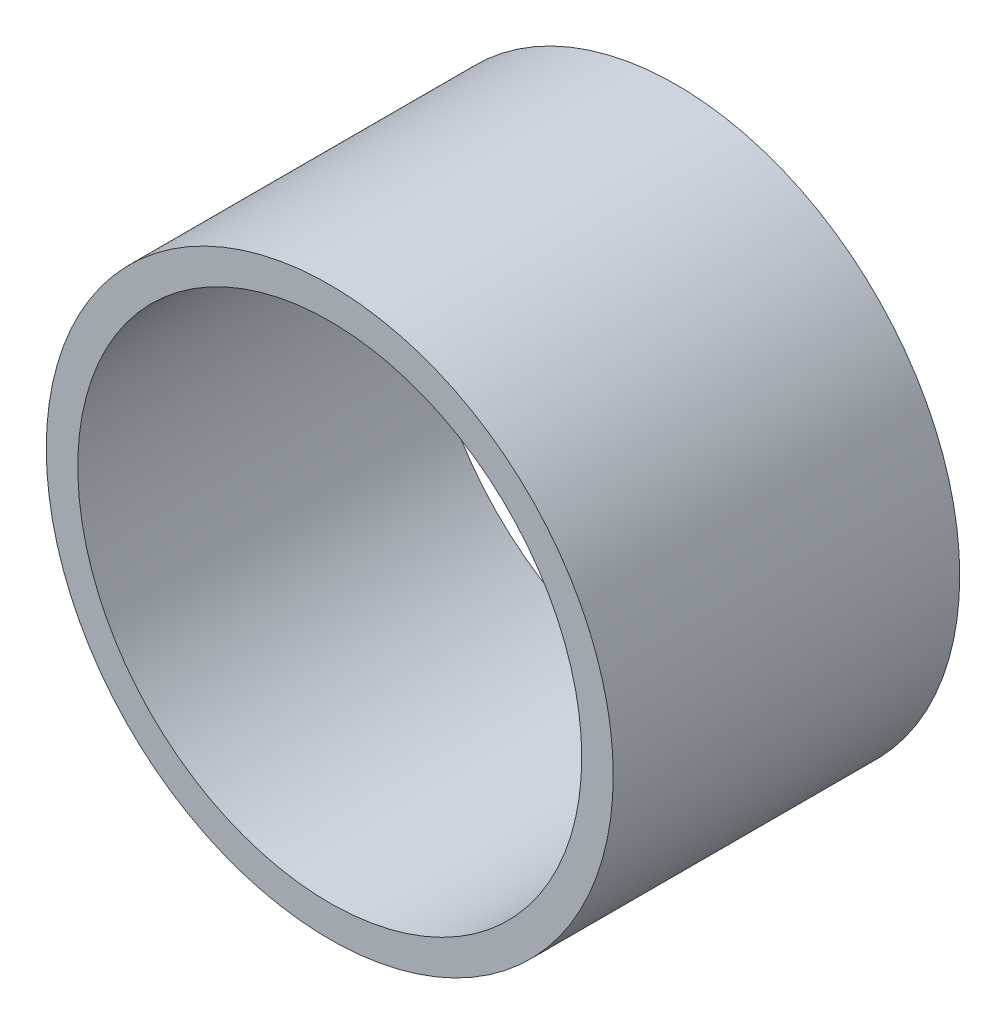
ISO-10303-21;
HEADER;
FILE_DESCRIPTION(('STEP AP214'),'2;1');
FILE_NAME('part.step','',(''),(''),'','','');
FILE_SCHEMA(('AUTOMOTIVE_DESIGN { 1 0 10303 214 1 1 1 1 }'));
ENDSEC;
DATA;
#1=APPLICATION_CONTEXT('core data for automotive mechanical design processes');
#2=APPLICATION_PROTOCOL_DEFINITION('international standard','automotive_design',2000,#1);
#3=PRODUCT_CONTEXT('',#1,'mechanical');
#4=PRODUCT('Part','Part','',(#3));
#5=PRODUCT_RELATED_PRODUCT_CATEGORY('part','',(#4));
#6=PRODUCT_DEFINITION_FORMATION('','',#4);
#7=PRODUCT_DEFINITION_CONTEXT('part definition',#1,'design');
#8=PRODUCT_DEFINITION('design','',#6,#7);
#9=PRODUCT_DEFINITION_SHAPE('','',#8);
#10=(LENGTH_UNIT() NAMED_UNIT(*) SI_UNIT(.MILLI.,.METRE.));
#11=(NAMED_UNIT(*) PLANE_ANGLE_UNIT() SI_UNIT($,.RADIAN.));
#12=(NAMED_UNIT(*) SI_UNIT($,.STERADIAN.) SOLID_ANGLE_UNIT());
#13=UNCERTAINTY_MEASURE_WITH_UNIT(LENGTH_MEASURE(1.E-05),#10,'distance_accuracy_value','');
#14=(GEOMETRIC_REPRESENTATION_CONTEXT(3) GLOBAL_UNCERTAINTY_ASSIGNED_CONTEXT((#13)) GLOBAL_UNIT_ASSIGNED_CONTEXT((#10,
#11,#12)) REPRESENTATION_CONTEXT('',''));
#15=CARTESIAN_POINT('',(0.,0.,0.));
#16=DIRECTION('',(0.,0.,1.));
#17=DIRECTION('',(1.,0.,0.));
#18=AXIS2_PLACEMENT_3D('',#15,#16,#17);
#19=CARTESIAN_POINT('',(0.,0.,22.));
#20=DIRECTION('',(0.,0.,1.));
#21=DIRECTION('',(1.,0.,0.));
#22=AXIS2_PLACEMENT_3D('',#19,#20,#21);
#23=PLANE('',#22);
#24=CARTESIAN_POINT('',(0.,0.,22.));
#25=DIRECTION('',(0.,0.,1.));
#26=DIRECTION('',(1.,0.,0.));
#27=AXIS2_PLACEMENT_3D('',#24,#25,#26);
#28=CIRCLE('',#27,18.);
#29=CARTESIAN_POINT('',(18.,0.,22.));
#30=VERTEX_POINT('',#29);
#31=EDGE_CURVE('E10',#30,#30,#28,.T.);
#32=ORIENTED_EDGE('',*,*,#31,.T.);
#33=EDGE_LOOP('',(#32));
#34=FACE_BOUND('',#33,.T.);
#35=CARTESIAN_POINT('',(0.,0.,22.));
#36=DIRECTION('',(0.,0.,1.));
#37=DIRECTION('',(1.,0.,0.));
#38=AXIS2_PLACEMENT_3D('',#35,#36,#37);
#39=CIRCLE('',#38,16.);
#40=CARTESIAN_POINT('',(16.,0.,22.));
#41=VERTEX_POINT('',#40);
#42=EDGE_CURVE('E41',#41,#41,#39,.T.);
#43=ORIENTED_EDGE('',*,*,#42,.F.);
#44=EDGE_LOOP('',(#43));
#45=FACE_BOUND('',#44,.T.);
#46=ADVANCED_FACE('F30',(#34,#45),#23,.T.);
#47=CARTESIAN_POINT('',(0.,0.,0.));
#48=DIRECTION('',(0.,0.,1.));
#49=DIRECTION('',(1.,0.,0.));
#50=AXIS2_PLACEMENT_3D('',#47,#48,#49);
#51=PLANE('',#50);
#52=CARTESIAN_POINT('',(0.,0.,0.));
#53=DIRECTION('',(0.,0.,1.));
#54=DIRECTION('',(1.,0.,0.));
#55=AXIS2_PLACEMENT_3D('',#52,#53,#54);
#56=CIRCLE('',#55,18.);
#57=CARTESIAN_POINT('',(18.,0.,0.));
#58=VERTEX_POINT('',#57);
#59=EDGE_CURVE('E34',#58,#58,#56,.T.);
#60=ORIENTED_EDGE('',*,*,#59,.F.);
#61=EDGE_LOOP('',(#60));
#62=FACE_BOUND('',#61,.T.);
#63=CARTESIAN_POINT('',(0.,0.,0.));
#64=DIRECTION('',(0.,0.,1.));
#65=DIRECTION('',(1.,0.,0.));
#66=AXIS2_PLACEMENT_3D('',#63,#64,#65);
#67=CIRCLE('',#66,16.);
#68=CARTESIAN_POINT('',(16.,0.,0.));
#69=VERTEX_POINT('',#68);
#70=EDGE_CURVE('E43',#69,#69,#67,.T.);
#71=ORIENTED_EDGE('',*,*,#70,.T.);
#72=EDGE_LOOP('',(#71));
#73=FACE_BOUND('',#72,.T.);
#74=ADVANCED_FACE('F53',(#62,#73),#51,.F.);
#75=CARTESIAN_POINT('',(0.,0.,22.));
#76=DIRECTION('',(0.,0.,-1.));
#77=DIRECTION('',(-1.,0.,0.));
#78=AXIS2_PLACEMENT_3D('',#75,#76,#77);
#79=CYLINDRICAL_SURFACE('',#78,18.);
#80=ORIENTED_EDGE('',*,*,#31,.F.);
#81=EDGE_LOOP('',(#80));
#82=FACE_BOUND('',#81,.T.);
#83=ORIENTED_EDGE('',*,*,#59,.T.);
#84=EDGE_LOOP('',(#83));
#85=FACE_BOUND('',#84,.T.);
#86=ADVANCED_FACE('F32',(#82,#85),#79,.T.);
#87=CARTESIAN_POINT('',(0.,0.,22.));
#88=DIRECTION('',(0.,0.,-1.));
#89=DIRECTION('',(-1.,0.,0.));
#90=AXIS2_PLACEMENT_3D('',#87,#88,#89);
#91=CYLINDRICAL_SURFACE('',#90,16.);
#92=ORIENTED_EDGE('',*,*,#42,.T.);
#93=EDGE_LOOP('',(#92));
#94=FACE_BOUND('',#93,.T.);
#95=ORIENTED_EDGE('',*,*,#70,.F.);
#96=EDGE_LOOP('',(#95));
#97=FACE_BOUND('',#96,.T.);
#98=ADVANCED_FACE('F49',(#94,#97),#91,.F.);
#99=CLOSED_SHELL('',(#46,#74,#86,#98));
#100=MANIFOLD_SOLID_BREP('B2',#99);
#101=ADVANCED_BREP_SHAPE_REPRESENTATION('',(#18,#100),#14);
#102=SHAPE_DEFINITION_REPRESENTATION(#9,#101);
ENDSEC;
END-ISO-10303-21;
